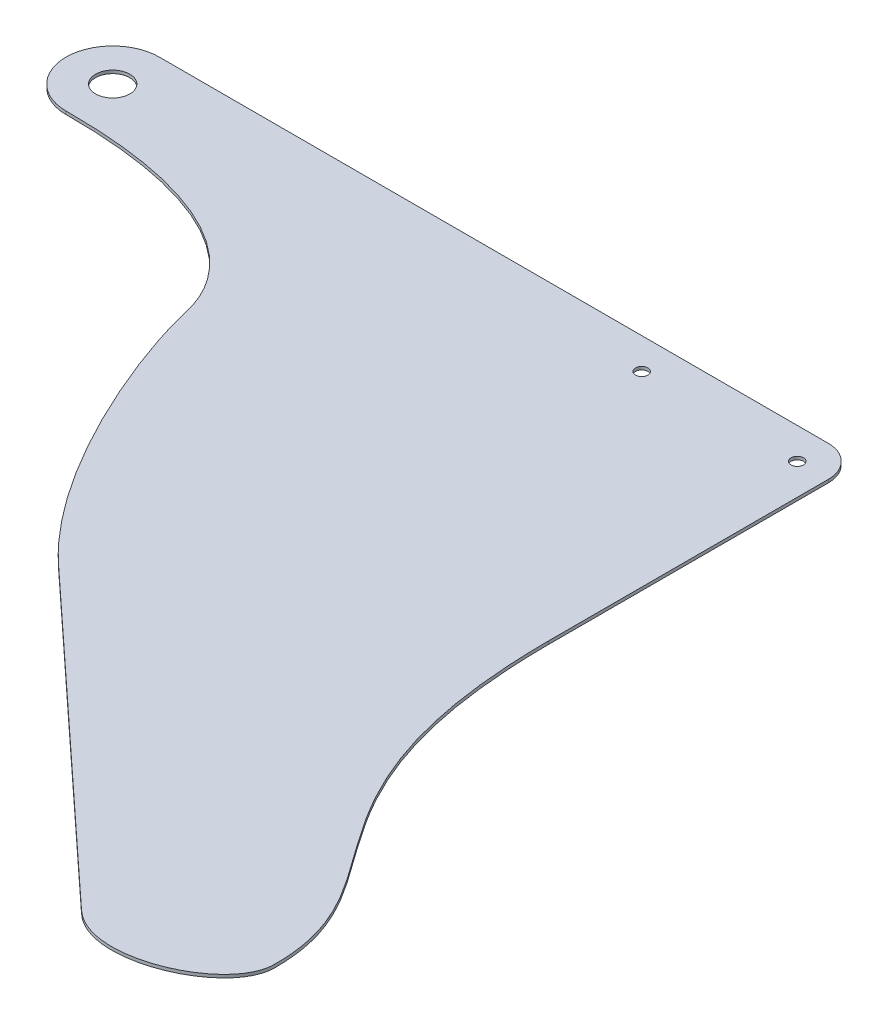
from build123d import *

# Parameters (mm, degrees)
ESQUISSE1_R      = 2.75
ESQUISSE1_R_2    = 1
EXTRUSION1_DEPTH = 0.5


with BuildPart() as part:
    # Esquisse1 → Extrusion1 (new body)
    with BuildSketch(Plane(origin=(0, 0, 0), x_dir=(1, 0, 0), z_dir=(0, 1, 0))):
        with BuildLine():
            Line((-5, 0), (-112.5, 0))
            ThreePointArc((-112.5, 0), (-120, -7.5), (-112.5, -15))
            add(Edge.make_bspline(
                [(-112.5, -15), (-86.760344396, -14.854369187), (-76.911743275, -24.563807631), (-72.605767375, -43.565334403), (-63.349248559, -66.303918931), (-50, -78.703703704)],
                knots=[0, 0, 0, 0, 0.443974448, 0.443974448, 1, 1, 1, 1], degree=3))
            Line((-50, -78.703703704), (0, -125))
            add(Edge.make_bspline(
                [(0, -50), (0.151156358, -94.079887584), (23.053080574, -94.63110929), (22.981752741, -124.689648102), (6.968072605, -131.524046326), (0, -125)],
                knots=[0, 0, 0, 0, 0.744177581, 0.744177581, 1, 1, 1, 1], degree=3))
            Line((0, -50), (0, -5))
            ThreePointArc((0, -5), (-1.464466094, -1.464466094), (-5, 0))
        make_face()
        with Locations(Location((-112.5, -7.5, 0), (0, 0, 270))):
            Circle(ESQUISSE1_R, mode=Mode.SUBTRACT)
        with Locations(Location((-5, -5, 0), (0, 0, 270))):
            Circle(ESQUISSE1_R_2, mode=Mode.SUBTRACT)
        with Locations(Location((-30, -5, 0), (0, 0, 270))):
            Circle(ESQUISSE1_R_2, mode=Mode.SUBTRACT)
    extrude(amount=-EXTRUSION1_DEPTH)


solid = part.part
